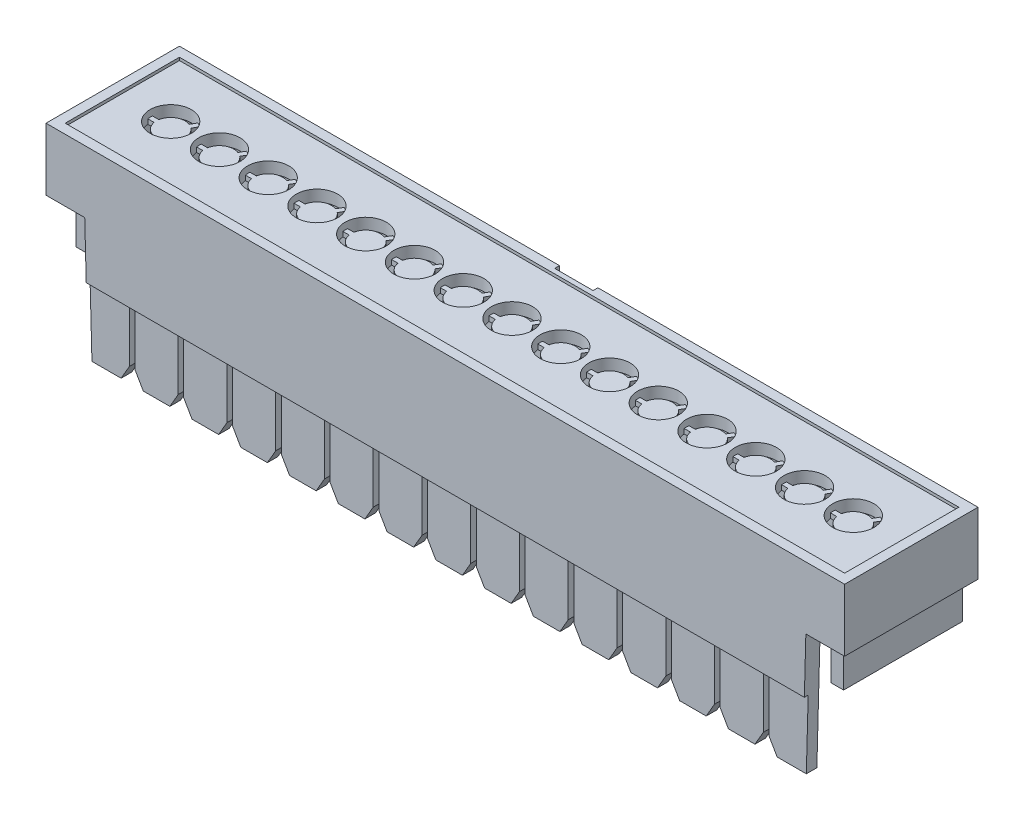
from build123d import *

# Parameters (mm, degrees)
SKETCH_1_W                 = 83.2
SKETCH_1_H                 = 13.9
EXTRUDE_1_DEPTH            = 6.5
SKETCH_2_W                 = 77.4
SKETCH_2_H                 = 10.9
CUT_EXTRUDE_1_DEPTH        = 5
EXTRUDE_2_DEPTH            = 4.6
CUT_EXTRUDE_2_DEPTH        = 1.5
SKETCH_5_W                 = 4
SKETCH_5_H                 = 0.5
CUT_EXTRUDE_3_DEPTH        = 6.5
EXTRUDE_3_DEPTH            = 1.5
EXTRUDE_4_DEPTH            = 1.5
EXTRUDE_5_DEPTH            = 1.1
SKETCH_9_W                 = 81.2
SKETCH_9_H                 = 11.9
CUT_EXTRUDE_4_DEPTH        = 0.3
SKETCH_10_R                = 2.15
CUT_EXTRUDE_5_DEPTH        = 0.7
CUT_EXTRUDE_6_DEPTH        = 0.5
PATTERN_LINEAR_1_COUNT     = 8
PATTERN_LINEAR_1_PITCH     = 5.08
PATTERN_LINEAR_1_COL_COUNT = 8
PATTERN_LINEAR_1_COL_PITCH = 5.08


with BuildPart() as part:
    # Sketch 1 → Extrude 1 (new body)
    with BuildSketch(Plane(origin=(0, 0, 0), x_dir=(1, 0, 0), z_dir=(0, 1, 0))):
        Rectangle(SKETCH_1_W, SKETCH_1_H)
    extrude(amount=-EXTRUDE_1_DEPTH)

    # Sketch 2 → Cut-Extrude 1 (cut)
    with BuildSketch(Plane.XZ.offset(6.5)):
        Rectangle(SKETCH_2_W, SKETCH_2_H)
    extrude(amount=-CUT_EXTRUDE_1_DEPTH, mode=Mode.SUBTRACT)

    # Sketch 3 → Extrude 2 (add)
    with BuildSketch(Plane.XZ.offset(6.5)):
        Polygon((-38.7, 5.45), (-40, 5.45), (-40, -6.95), (40, -6.95), (40, 5.45), (38.7, 5.45), (38.7, -5.45), (-38.7, -5.45), align=None)
    extrude(amount=EXTRUDE_2_DEPTH)

    # Sketch 4 → Cut-Extrude 2 (cut)
    with BuildSketch(Plane(origin=(0, 0, -6.95), x_dir=(-1, 0, 0), z_dir=(0, 0, -1))):
        Polygon((-38.7, -11.1), (-38.7, -1.5), (-37.7, -1.5), (-37.467290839, -10.1), (37.467290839, -10.1), (37.7, -1.5), (38.7, -1.5), (38.7, -11.1), align=None)
    extrude(amount=-CUT_EXTRUDE_2_DEPTH, mode=Mode.SUBTRACT)

    # Sketch 5 → Cut-Extrude 3 (cut)
    with BuildSketch(Plane(origin=(0, 0, 0), x_dir=(1, 0, 0), z_dir=(0, 1, 0))):
        with Locations((0, 6.7)):
            Rectangle(SKETCH_5_W, SKETCH_5_H)
    extrude(amount=-CUT_EXTRUDE_3_DEPTH, mode=Mode.SUBTRACT)

    # Sketch 6 → Extrude 3 (add, symmetric)
    with BuildSketch(Plane(origin=(0, 0, 0), x_dir=(0, 0, -1), z_dir=(1, 0, 0))):
        Polygon((6.95, -6.5), (7.95, -6.5), (6.95, -8.9), align=None)
    extrude(amount=EXTRUDE_3_DEPTH, both=True)

    # Sketch 7 → Extrude 4 (add)
    with BuildSketch(Plane.XY.offset(6.95)):
        Polygon((-37.564703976, -6.5), (37.564703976, -6.5), (37.407760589, -12.3), (-37.407760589, -12.3), align=None)
    extrude(amount=-EXTRUDE_4_DEPTH)

    # Sketch 8 → Extrude 5 (add)
    with BuildSketch(Plane(origin=(0, 0, 5.45), x_dir=(-1, 0, 0), z_dir=(0, 0, -1))):
        Polygon((37.407760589, -12.3), (33.31, -12.3), (33.31, -18), (34.176025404, -19.5), (37.212934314, -19.5), align=None)
        Polygon((32.73, -12.3), (28.23, -12.3), (28.23, -18), (29.096025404, -19.5), (31.863974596, -19.5), (32.73, -18), align=None)
        Polygon((27.65, -12.3), (23.15, -12.3), (23.15, -18), (24.016025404, -19.5), (26.783974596, -19.5), (27.65, -18), align=None)
        Polygon((22.57, -12.3), (18.07, -12.3), (18.07, -18), (18.936025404, -19.5), (21.703974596, -19.5), (22.57, -18), align=None)
        Polygon((17.49, -12.3), (12.99, -12.3), (12.99, -18), (13.856025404, -19.5), (16.623974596, -19.5), (17.49, -18), align=None)
        Polygon((12.41, -12.3), (7.91, -12.3), (7.91, -18), (8.776025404, -19.5), (11.543974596, -19.5), (12.41, -18), align=None)
        Polygon((7.33, -12.3), (2.83, -12.3), (2.83, -18), (3.696025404, -19.5), (6.463974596, -19.5), (7.33, -18), align=None)
        Polygon((2.25, -12.3), (-2.25, -12.3), (-2.25, -18), (-1.383974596, -19.5), (1.383974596, -19.5), (2.25, -18), align=None)
        Polygon((-2.83, -12.3), (-7.33, -12.3), (-7.33, -18), (-6.463974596, -19.5), (-3.696025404, -19.5), (-2.83, -18), align=None)
        Polygon((-7.91, -12.3), (-12.41, -12.3), (-12.41, -18), (-11.543974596, -19.5), (-8.776025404, -19.5), (-7.91, -18), align=None)
        Polygon((-12.99, -12.3), (-17.49, -12.3), (-17.49, -18), (-16.623974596, -19.5), (-13.856025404, -19.5), (-12.99, -18), align=None)
        Polygon((-18.07, -12.3), (-22.57, -12.3), (-22.57, -18), (-21.703974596, -19.5), (-18.936025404, -19.5), (-18.07, -18), align=None)
        Polygon((-23.15, -12.3), (-27.65, -12.3), (-27.65, -18), (-26.783974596, -19.5), (-24.016025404, -19.5), (-23.15, -18), align=None)
        Polygon((-28.23, -12.3), (-32.73, -12.3), (-32.73, -18), (-31.863974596, -19.5), (-29.096025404, -19.5), (-28.23, -18), align=None)
        Polygon((-33.31, -12.3), (-37.407760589, -12.3), (-37.212934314, -19.5), (-34.176025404, -19.5), (-33.31, -18), align=None)
    extrude(amount=-EXTRUDE_5_DEPTH)

    # Sketch 9 → Cut-Extrude 4 (cut)
    with BuildSketch(Plane(origin=(0, 0, 0), x_dir=(1, 0, 0), z_dir=(0, 1, 0))):
        Rectangle(SKETCH_9_W, SKETCH_9_H)
    extrude(amount=-CUT_EXTRUDE_4_DEPTH, mode=Mode.SUBTRACT)

    # Sketch 10 → Cut-Extrude 5 (cut)
    with BuildSketch(Plane(origin=(0, -0.3, 0), x_dir=(1, 0, 0), z_dir=(0, 1, 0))):
        with Locations(Location((0, 0, 0), (0, 0, 270))):
            Circle(SKETCH_10_R)
    cut_extrude_5 = extrude(amount=-CUT_EXTRUDE_5_DEPTH, mode=Mode.SUBTRACT)

    # Sketch 11 → Cut-Extrude 6 (cut)
    with BuildSketch(Plane(origin=(0, -1, 0), x_dir=(1, 0, 0), z_dir=(0, 1, 0))):
        with BuildLine():
            Line((-2.13541565, 0.25), (-1.479019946, 0.25))
            ThreePointArc((-1.479019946, 0.25), (-0.75, 1.299038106), (0.523003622, 1.405868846))
            Line((0.523003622, 1.405868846), (0.851201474, 1.974324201))
            ThreePointArc((0.851201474, 1.974324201), (-1.075, 1.861954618), (-2.13541565, 0.25))
        make_face()
        with BuildLine():
            ThreePointArc((0.523003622, -1.405868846), (-0.75, -1.299038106), (-1.479019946, -0.25))
            Line((-1.479019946, -0.25), (-2.13541565, -0.25))
            ThreePointArc((-2.13541565, -0.25), (-1.075, -1.861954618), (0.851201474, -1.974324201))
            Line((0.851201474, -1.974324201), (0.523003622, -1.405868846))
        make_face()
        with BuildLine():
            Line((1.284214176, 1.724324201), (0.956016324, 1.155868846))
            ThreePointArc((0.956016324, 1.155868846), (1.357207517, 0.638739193), (1.5, 0))
            ThreePointArc((1.5, 0), (1.357207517, -0.638739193), (0.956016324, -1.155868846))
            Line((0.956016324, -1.155868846), (1.284214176, -1.724324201))
            ThreePointArc((1.284214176, -1.724324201), (1.921400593, -0.964738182), (2.15, 0))
            ThreePointArc((2.15, 0), (1.921400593, 0.964738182), (1.284214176, 1.724324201))
        make_face()
    cut_extrude_6 = extrude(amount=-CUT_EXTRUDE_6_DEPTH, mode=Mode.SUBTRACT)

    # Pattern Linear 1: Cut-Extrude 5, Cut-Extrude 6 ×8
    with Locations(*[(-i * PATTERN_LINEAR_1_PITCH, 0, 0) for i in range(1, PATTERN_LINEAR_1_COUNT)]):
        add(cut_extrude_5, mode=Mode.SUBTRACT)
        add(cut_extrude_6, mode=Mode.SUBTRACT)

    # Pattern Linear 1 col: Cut-Extrude 5, Cut-Extrude 6 ×8
    with Locations(*[(i * PATTERN_LINEAR_1_COL_PITCH, 0, 0) for i in range(1, PATTERN_LINEAR_1_COL_COUNT)]):
        add(cut_extrude_5, mode=Mode.SUBTRACT)
        add(cut_extrude_6, mode=Mode.SUBTRACT)


solid = part.part
